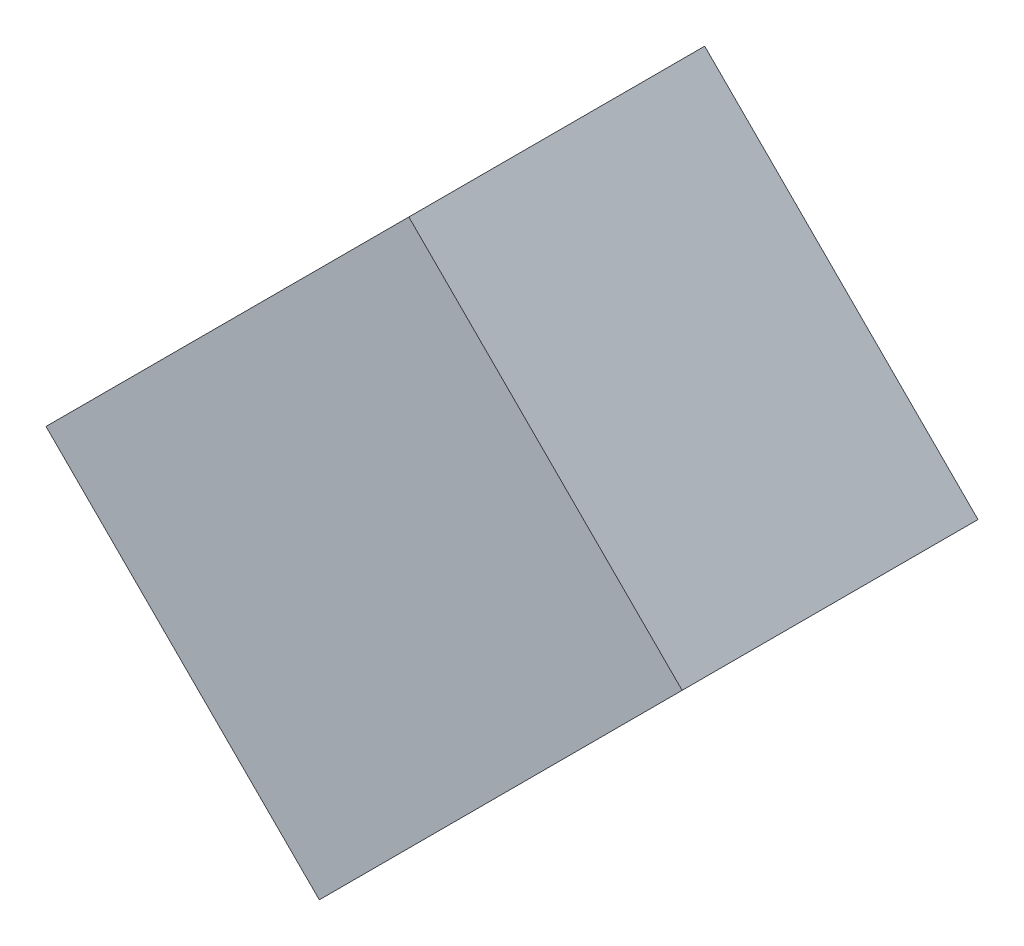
ISO-10303-21;
HEADER;
FILE_DESCRIPTION(('STEP AP214'),'2;1');
FILE_NAME('part.step','',(''),(''),'','','');
FILE_SCHEMA(('AUTOMOTIVE_DESIGN { 1 0 10303 214 1 1 1 1 }'));
ENDSEC;
DATA;
#1=APPLICATION_CONTEXT('core data for automotive mechanical design processes');
#2=APPLICATION_PROTOCOL_DEFINITION('international standard','automotive_design',2000,#1);
#3=PRODUCT_CONTEXT('',#1,'mechanical');
#4=PRODUCT('Part','Part','',(#3));
#5=PRODUCT_RELATED_PRODUCT_CATEGORY('part','',(#4));
#6=PRODUCT_DEFINITION_FORMATION('','',#4);
#7=PRODUCT_DEFINITION_CONTEXT('part definition',#1,'design');
#8=PRODUCT_DEFINITION('design','',#6,#7);
#9=PRODUCT_DEFINITION_SHAPE('','',#8);
#10=(LENGTH_UNIT() NAMED_UNIT(*) SI_UNIT(.MILLI.,.METRE.));
#11=(NAMED_UNIT(*) PLANE_ANGLE_UNIT() SI_UNIT($,.RADIAN.));
#12=(NAMED_UNIT(*) SI_UNIT($,.STERADIAN.) SOLID_ANGLE_UNIT());
#13=UNCERTAINTY_MEASURE_WITH_UNIT(LENGTH_MEASURE(1.E-05),#10,'distance_accuracy_value','');
#14=(GEOMETRIC_REPRESENTATION_CONTEXT(3) GLOBAL_UNCERTAINTY_ASSIGNED_CONTEXT((#13)) GLOBAL_UNIT_ASSIGNED_CONTEXT((#10,
#11,#12)) REPRESENTATION_CONTEXT('',''));
#15=CARTESIAN_POINT('',(0.,0.,0.));
#16=DIRECTION('',(0.,0.,1.));
#17=DIRECTION('',(1.,0.,0.));
#18=AXIS2_PLACEMENT_3D('',#15,#16,#17);
#19=CARTESIAN_POINT('',(3.621822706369E-07,-3.621822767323E-07,0.22999954));
#20=DIRECTION('',(0.,0.,-1.));
#21=DIRECTION('',(0.,-1.,0.));
#22=AXIS2_PLACEMENT_3D('',#19,#20,#21);
#23=PLANE('',#22);
#24=DIRECTION('',(-0.707111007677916,0.707102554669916,0.));
#25=VECTOR('',#24,1.);
#26=CARTESIAN_POINT('',(-0.03479800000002,-0.24727408,0.22999954));
#27=LINE('',#26,#25);
#28=CARTESIAN_POINT('',(-0.03479800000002,-0.24727408,0.22999954));
#29=VERTEX_POINT('',#28);
#30=CARTESIAN_POINT('',(-0.24727408,-0.03480053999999,0.22999954));
#31=VERTEX_POINT('',#30);
#32=EDGE_CURVE('E20',#29,#31,#27,.T.);
#33=ORIENTED_EDGE('',*,*,#32,.F.);
#34=DIRECTION('',(-0.707106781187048,-0.707106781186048,0.));
#35=VECTOR('',#34,1.);
#36=CARTESIAN_POINT('',(0.24727408,0.03479799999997,0.22999954));
#37=LINE('',#36,#35);
#38=CARTESIAN_POINT('',(0.24727408,0.03479799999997,0.22999954));
#39=VERTEX_POINT('',#38);
#40=EDGE_CURVE('E108',#39,#29,#37,.T.);
#41=ORIENTED_EDGE('',*,*,#40,.F.);
#42=DIRECTION('',(0.707102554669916,-0.707111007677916,0.));
#43=VECTOR('',#42,1.);
#44=CARTESIAN_POINT('',(0.03480053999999,0.24727408,0.22999954));
#45=LINE('',#44,#43);
#46=CARTESIAN_POINT('',(0.03480053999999,0.24727408,0.22999954));
#47=VERTEX_POINT('',#46);
#48=EDGE_CURVE('E84',#47,#39,#45,.T.);
#49=ORIENTED_EDGE('',*,*,#48,.F.);
#50=DIRECTION('',(0.707106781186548,0.707106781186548,0.));
#51=VECTOR('',#50,1.);
#52=CARTESIAN_POINT('',(-0.24727408,-0.03480053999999,0.22999954));
#53=LINE('',#52,#51);
#54=EDGE_CURVE('E88',#31,#47,#53,.T.);
#55=ORIENTED_EDGE('',*,*,#54,.F.);
#56=EDGE_LOOP('',(#33,#41,#49,#55));
#57=FACE_BOUND('',#56,.T.);
#58=ADVANCED_FACE('F17',(#57),#23,.F.);
#59=CARTESIAN_POINT('',(3.621822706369E-07,-3.621822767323E-07,0.));
#60=DIRECTION('',(0.,0.,-1.));
#61=DIRECTION('',(0.,-1.,0.));
#62=AXIS2_PLACEMENT_3D('',#59,#60,#61);
#63=PLANE('',#62);
#64=DIRECTION('',(0.707106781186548,0.707106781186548,0.));
#65=VECTOR('',#64,1.);
#66=CARTESIAN_POINT('',(-0.24727408,-0.03480053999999,0.));
#67=LINE('',#66,#65);
#68=CARTESIAN_POINT('',(-0.24727408,-0.03480053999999,0.));
#69=VERTEX_POINT('',#68);
#70=CARTESIAN_POINT('',(0.03480053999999,0.24727408,0.));
#71=VERTEX_POINT('',#70);
#72=EDGE_CURVE('E72',#69,#71,#67,.T.);
#73=ORIENTED_EDGE('',*,*,#72,.T.);
#74=DIRECTION('',(0.707102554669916,-0.707111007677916,0.));
#75=VECTOR('',#74,1.);
#76=CARTESIAN_POINT('',(0.03480053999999,0.24727408,0.));
#77=LINE('',#76,#75);
#78=CARTESIAN_POINT('',(0.24727408,0.03479799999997,0.));
#79=VERTEX_POINT('',#78);
#80=EDGE_CURVE('E105',#71,#79,#77,.T.);
#81=ORIENTED_EDGE('',*,*,#80,.T.);
#82=DIRECTION('',(-0.707106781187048,-0.707106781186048,0.));
#83=VECTOR('',#82,1.);
#84=CARTESIAN_POINT('',(0.24727408,0.03479799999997,0.));
#85=LINE('',#84,#83);
#86=CARTESIAN_POINT('',(-0.03479800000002,-0.24727408,0.));
#87=VERTEX_POINT('',#86);
#88=EDGE_CURVE('E74',#79,#87,#85,.T.);
#89=ORIENTED_EDGE('',*,*,#88,.T.);
#90=DIRECTION('',(-0.707111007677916,0.707102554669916,0.));
#91=VECTOR('',#90,1.);
#92=CARTESIAN_POINT('',(-0.03479800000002,-0.24727408,0.));
#93=LINE('',#92,#91);
#94=EDGE_CURVE('E11',#87,#69,#93,.T.);
#95=ORIENTED_EDGE('',*,*,#94,.T.);
#96=EDGE_LOOP('',(#73,#81,#89,#95));
#97=FACE_BOUND('',#96,.T.);
#98=ADVANCED_FACE('F70',(#97),#63,.T.);
#99=CARTESIAN_POINT('',(-0.03479800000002,-0.24727408,0.));
#100=DIRECTION('',(-0.707102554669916,-0.707111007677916,0.));
#101=DIRECTION('',(-0.707111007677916,0.707102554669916,0.));
#102=AXIS2_PLACEMENT_3D('',#99,#100,#101);
#103=PLANE('',#102);
#104=DIRECTION('',(0.,0.,1.));
#105=VECTOR('',#104,1.);
#106=CARTESIAN_POINT('',(-0.03479800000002,-0.24727408,0.));
#107=LINE('',#106,#105);
#108=EDGE_CURVE('E112',#87,#29,#107,.T.);
#109=ORIENTED_EDGE('',*,*,#108,.T.);
#110=ORIENTED_EDGE('',*,*,#32,.T.);
#111=DIRECTION('',(0.,0.,1.));
#112=VECTOR('',#111,1.);
#113=CARTESIAN_POINT('',(-0.24727408,-0.03480053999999,0.));
#114=LINE('',#113,#112);
#115=EDGE_CURVE('E80',#69,#31,#114,.T.);
#116=ORIENTED_EDGE('',*,*,#115,.F.);
#117=ORIENTED_EDGE('',*,*,#94,.F.);
#118=EDGE_LOOP('',(#109,#110,#116,#117));
#119=FACE_BOUND('',#118,.T.);
#120=ADVANCED_FACE('F86',(#119),#103,.T.);
#121=CARTESIAN_POINT('',(0.24727408,0.03479799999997,0.));
#122=DIRECTION('',(0.707106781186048,-0.707106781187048,0.));
#123=DIRECTION('',(0.,0.,-1.));
#124=AXIS2_PLACEMENT_3D('',#121,#122,#123);
#125=PLANE('',#124);
#126=DIRECTION('',(0.,0.,1.));
#127=VECTOR('',#126,1.);
#128=CARTESIAN_POINT('',(0.24727408,0.03479799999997,0.));
#129=LINE('',#128,#127);
#130=EDGE_CURVE('E101',#79,#39,#129,.T.);
#131=ORIENTED_EDGE('',*,*,#130,.T.);
#132=ORIENTED_EDGE('',*,*,#40,.T.);
#133=ORIENTED_EDGE('',*,*,#108,.F.);
#134=ORIENTED_EDGE('',*,*,#88,.F.);
#135=EDGE_LOOP('',(#131,#132,#133,#134));
#136=FACE_BOUND('',#135,.T.);
#137=ADVANCED_FACE('F144',(#136),#125,.T.);
#138=CARTESIAN_POINT('',(0.03480053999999,0.24727408,0.));
#139=DIRECTION('',(0.707111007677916,0.707102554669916,0.));
#140=DIRECTION('',(0.,0.,-1.));
#141=AXIS2_PLACEMENT_3D('',#138,#139,#140);
#142=PLANE('',#141);
#143=DIRECTION('',(0.,0.,1.));
#144=VECTOR('',#143,1.);
#145=CARTESIAN_POINT('',(0.03480053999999,0.24727408,0.));
#146=LINE('',#145,#144);
#147=EDGE_CURVE('E82',#71,#47,#146,.T.);
#148=ORIENTED_EDGE('',*,*,#147,.T.);
#149=ORIENTED_EDGE('',*,*,#48,.T.);
#150=ORIENTED_EDGE('',*,*,#130,.F.);
#151=ORIENTED_EDGE('',*,*,#80,.F.);
#152=EDGE_LOOP('',(#148,#149,#150,#151));
#153=FACE_BOUND('',#152,.T.);
#154=ADVANCED_FACE('F134',(#153),#142,.T.);
#155=CARTESIAN_POINT('',(-0.24727408,-0.03480053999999,0.));
#156=DIRECTION('',(-0.707106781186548,0.707106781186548,0.));
#157=DIRECTION('',(0.,0.,1.));
#158=AXIS2_PLACEMENT_3D('',#155,#156,#157);
#159=PLANE('',#158);
#160=ORIENTED_EDGE('',*,*,#115,.T.);
#161=ORIENTED_EDGE('',*,*,#54,.T.);
#162=ORIENTED_EDGE('',*,*,#147,.F.);
#163=ORIENTED_EDGE('',*,*,#72,.F.);
#164=EDGE_LOOP('',(#160,#161,#162,#163));
#165=FACE_BOUND('',#164,.T.);
#166=ADVANCED_FACE('F78',(#165),#159,.T.);
#167=CLOSED_SHELL('',(#58,#98,#120,#137,#154,#166));
#168=MANIFOLD_SOLID_BREP('B1',#167);
#169=ADVANCED_BREP_SHAPE_REPRESENTATION('',(#18,#168),#14);
#170=SHAPE_DEFINITION_REPRESENTATION(#9,#169);
ENDSEC;
END-ISO-10303-21;
